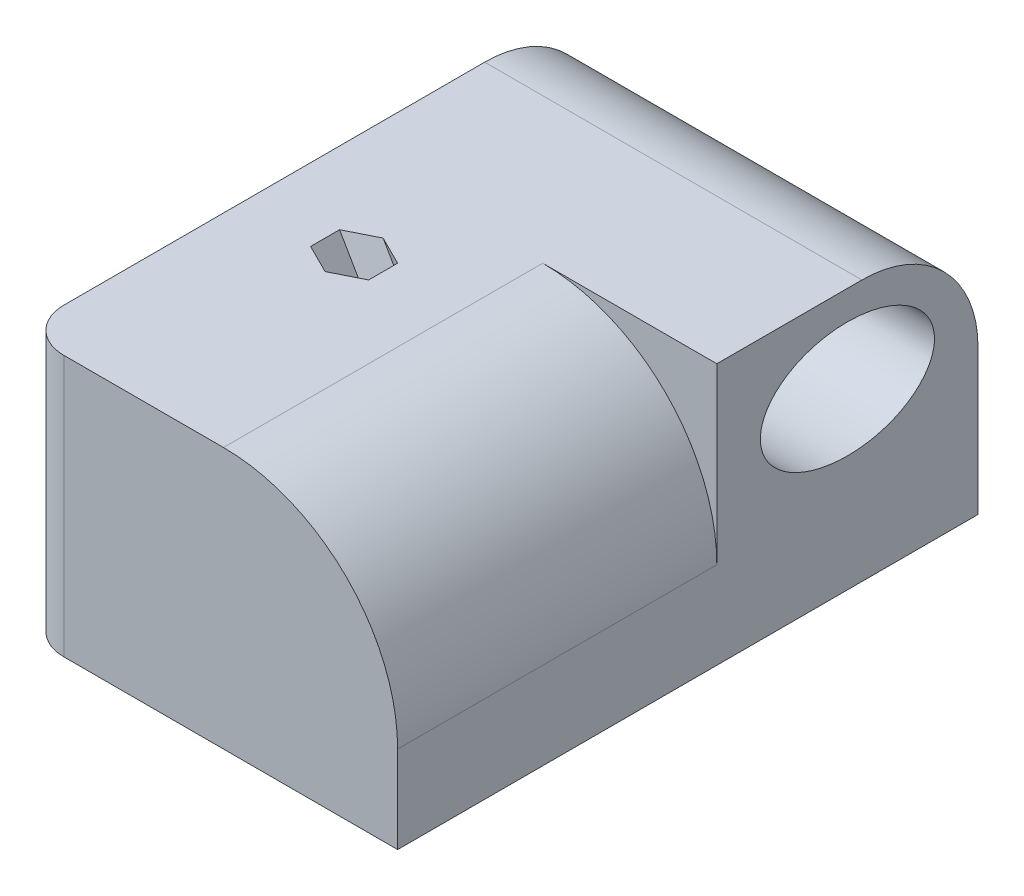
ISO-10303-21;
HEADER;
FILE_DESCRIPTION(('STEP AP214'),'2;1');
FILE_NAME('part.step','',(''),(''),'','','');
FILE_SCHEMA(('AUTOMOTIVE_DESIGN { 1 0 10303 214 1 1 1 1 }'));
ENDSEC;
DATA;
#1=APPLICATION_CONTEXT('core data for automotive mechanical design processes');
#2=APPLICATION_PROTOCOL_DEFINITION('international standard','automotive_design',2000,#1);
#3=PRODUCT_CONTEXT('',#1,'mechanical');
#4=PRODUCT('Part','Part','',(#3));
#5=PRODUCT_RELATED_PRODUCT_CATEGORY('part','',(#4));
#6=PRODUCT_DEFINITION_FORMATION('','',#4);
#7=PRODUCT_DEFINITION_CONTEXT('part definition',#1,'design');
#8=PRODUCT_DEFINITION('design','',#6,#7);
#9=PRODUCT_DEFINITION_SHAPE('','',#8);
#10=(LENGTH_UNIT() NAMED_UNIT(*) SI_UNIT(.MILLI.,.METRE.));
#11=(NAMED_UNIT(*) PLANE_ANGLE_UNIT() SI_UNIT($,.RADIAN.));
#12=(NAMED_UNIT(*) SI_UNIT($,.STERADIAN.) SOLID_ANGLE_UNIT());
#13=UNCERTAINTY_MEASURE_WITH_UNIT(LENGTH_MEASURE(1.E-05),#10,'distance_accuracy_value','');
#14=(GEOMETRIC_REPRESENTATION_CONTEXT(3) GLOBAL_UNCERTAINTY_ASSIGNED_CONTEXT((#13)) GLOBAL_UNIT_ASSIGNED_CONTEXT((#10,
#11,#12)) REPRESENTATION_CONTEXT('',''));
#15=CARTESIAN_POINT('',(0.,0.,0.));
#16=DIRECTION('',(0.,0.,1.));
#17=DIRECTION('',(1.,0.,0.));
#18=AXIS2_PLACEMENT_3D('',#15,#16,#17);
#19=CARTESIAN_POINT('',(-65.,90.,100.));
#20=DIRECTION('',(0.,0.,-1.));
#21=DIRECTION('',(-1.,0.,0.));
#22=AXIS2_PLACEMENT_3D('',#19,#20,#21);
#23=PLANE('',#22);
#24=DIRECTION('',(0.,-1.,0.));
#25=VECTOR('',#24,1.);
#26=CARTESIAN_POINT('',(65.,90.,100.));
#27=LINE('',#26,#25);
#28=CARTESIAN_POINT('',(65.,30.,100.));
#29=VERTEX_POINT('',#28);
#30=CARTESIAN_POINT('',(65.,0.,100.));
#31=VERTEX_POINT('',#30);
#32=EDGE_CURVE('E223',#29,#31,#27,.T.);
#33=ORIENTED_EDGE('',*,*,#32,.F.);
#34=CARTESIAN_POINT('',(5.00000000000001,30.,100.));
#35=DIRECTION('',(0.,0.,-1.));
#36=DIRECTION('',(-1.,0.,0.));
#37=AXIS2_PLACEMENT_3D('',#34,#35,#36);
#38=CIRCLE('',#37,60.);
#39=CARTESIAN_POINT('',(5.,90.,100.));
#40=VERTEX_POINT('',#39);
#41=EDGE_CURVE('E272',#29,#40,#38,.F.);
#42=ORIENTED_EDGE('',*,*,#41,.T.);
#43=DIRECTION('',(1.,0.,0.));
#44=VECTOR('',#43,1.);
#45=CARTESIAN_POINT('',(-65.,90.,100.));
#46=LINE('',#45,#44);
#47=CARTESIAN_POINT('',(-50.,90.,100.));
#48=VERTEX_POINT('',#47);
#49=EDGE_CURVE('E192',#48,#40,#46,.T.);
#50=ORIENTED_EDGE('',*,*,#49,.F.);
#51=DIRECTION('',(0.,-1.,0.));
#52=VECTOR('',#51,1.);
#53=CARTESIAN_POINT('',(-50.,0.,100.));
#54=LINE('',#53,#52);
#55=CARTESIAN_POINT('',(-50.,0.,100.));
#56=VERTEX_POINT('',#55);
#57=EDGE_CURVE('E226',#48,#56,#54,.T.);
#58=ORIENTED_EDGE('',*,*,#57,.T.);
#59=DIRECTION('',(1.,0.,0.));
#60=VECTOR('',#59,1.);
#61=CARTESIAN_POINT('',(-65.,0.,100.));
#62=LINE('',#61,#60);
#63=EDGE_CURVE('E191',#56,#31,#62,.T.);
#64=ORIENTED_EDGE('',*,*,#63,.T.);
#65=EDGE_LOOP('',(#33,#42,#50,#58,#64));
#66=FACE_BOUND('',#65,.T.);
#67=ADVANCED_FACE('F43',(#66),#23,.F.);
#68=CARTESIAN_POINT('',(65.,90.,100.));
#69=DIRECTION('',(-1.,0.,0.));
#70=DIRECTION('',(0.,0.,1.));
#71=AXIS2_PLACEMENT_3D('',#68,#69,#70);
#72=PLANE('',#71);
#73=CARTESIAN_POINT('',(65.,60.,-55.));
#74=DIRECTION('',(1.,0.,0.));
#75=DIRECTION('',(0.,0.,-1.));
#76=AXIS2_PLACEMENT_3D('',#73,#74,#75);
#77=ELLIPSE('',#76,30.,20.);
#78=CARTESIAN_POINT('',(65.,60.,-85.));
#79=VERTEX_POINT('',#78);
#80=EDGE_CURVE('E292',#79,#79,#77,.T.);
#81=ORIENTED_EDGE('',*,*,#80,.F.);
#82=EDGE_LOOP('',(#81));
#83=FACE_BOUND('',#82,.T.);
#84=DIRECTION('',(0.,-1.,0.));
#85=VECTOR('',#84,1.);
#86=CARTESIAN_POINT('',(65.,90.,-100.));
#87=LINE('',#86,#85);
#88=CARTESIAN_POINT('',(65.,50.,-100.));
#89=VERTEX_POINT('',#88);
#90=CARTESIAN_POINT('',(65.,0.,-100.));
#91=VERTEX_POINT('',#90);
#92=EDGE_CURVE('E220',#89,#91,#87,.T.);
#93=ORIENTED_EDGE('',*,*,#92,.F.);
#94=CARTESIAN_POINT('',(65.,50.,-60.));
#95=DIRECTION('',(-1.,0.,0.));
#96=DIRECTION('',(0.,0.,1.));
#97=AXIS2_PLACEMENT_3D('',#94,#95,#96);
#98=CIRCLE('',#97,40.);
#99=CARTESIAN_POINT('',(65.,90.,-60.));
#100=VERTEX_POINT('',#99);
#101=EDGE_CURVE('E66',#89,#100,#98,.F.);
#102=ORIENTED_EDGE('',*,*,#101,.T.);
#103=DIRECTION('',(0.,0.,-1.));
#104=VECTOR('',#103,1.);
#105=CARTESIAN_POINT('',(65.,90.,100.));
#106=LINE('',#105,#104);
#107=CARTESIAN_POINT('',(65.,90.,-9.99999999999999));
#108=VERTEX_POINT('',#107);
#109=EDGE_CURVE('E196',#108,#100,#106,.T.);
#110=ORIENTED_EDGE('',*,*,#109,.F.);
#111=DIRECTION('',(0.,-1.,0.));
#112=VECTOR('',#111,1.);
#113=CARTESIAN_POINT('',(65.,30.,-9.99999999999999));
#114=LINE('',#113,#112);
#115=CARTESIAN_POINT('',(65.,30.,-9.99999999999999));
#116=VERTEX_POINT('',#115);
#117=EDGE_CURVE('E269',#108,#116,#114,.T.);
#118=ORIENTED_EDGE('',*,*,#117,.T.);
#119=DIRECTION('',(0.,0.,-1.));
#120=VECTOR('',#119,1.);
#121=CARTESIAN_POINT('',(65.,30.,100.));
#122=LINE('',#121,#120);
#123=EDGE_CURVE('E266',#116,#29,#122,.F.);
#124=ORIENTED_EDGE('',*,*,#123,.T.);
#125=ORIENTED_EDGE('',*,*,#32,.T.);
#126=DIRECTION('',(0.,0.,-1.));
#127=VECTOR('',#126,1.);
#128=CARTESIAN_POINT('',(65.,0.,100.));
#129=LINE('',#128,#127);
#130=EDGE_CURVE('E207',#31,#91,#129,.T.);
#131=ORIENTED_EDGE('',*,*,#130,.T.);
#132=EDGE_LOOP('',(#93,#102,#110,#118,#124,#125,#131));
#133=FACE_BOUND('',#132,.T.);
#134=ADVANCED_FACE('F359',(#83,#133),#72,.F.);
#135=CARTESIAN_POINT('',(-65.,90.,-100.));
#136=DIRECTION('',(0.,0.,-1.));
#137=DIRECTION('',(-1.,0.,0.));
#138=AXIS2_PLACEMENT_3D('',#135,#136,#137);
#139=PLANE('',#138);
#140=DIRECTION('',(0.,-1.,0.));
#141=VECTOR('',#140,1.);
#142=CARTESIAN_POINT('',(-65.,90.,-100.));
#143=LINE('',#142,#141);
#144=CARTESIAN_POINT('',(-65.,50.,-100.));
#145=VERTEX_POINT('',#144);
#146=CARTESIAN_POINT('',(-65.,0.,-100.));
#147=VERTEX_POINT('',#146);
#148=EDGE_CURVE('E203',#145,#147,#143,.T.);
#149=ORIENTED_EDGE('',*,*,#148,.F.);
#150=DIRECTION('',(1.,0.,0.));
#151=VECTOR('',#150,1.);
#152=CARTESIAN_POINT('',(-65.,50.,-100.));
#153=LINE('',#152,#151);
#154=EDGE_CURVE('E275',#145,#89,#153,.T.);
#155=ORIENTED_EDGE('',*,*,#154,.T.);
#156=ORIENTED_EDGE('',*,*,#92,.T.);
#157=DIRECTION('',(1.,0.,0.));
#158=VECTOR('',#157,1.);
#159=CARTESIAN_POINT('',(-65.,0.,-100.));
#160=LINE('',#159,#158);
#161=EDGE_CURVE('E211',#147,#91,#160,.T.);
#162=ORIENTED_EDGE('',*,*,#161,.F.);
#163=EDGE_LOOP('',(#149,#155,#156,#162));
#164=FACE_BOUND('',#163,.T.);
#165=ADVANCED_FACE('F355',(#164),#139,.T.);
#166=CARTESIAN_POINT('',(-65.,90.,100.));
#167=DIRECTION('',(-1.,0.,0.));
#168=DIRECTION('',(0.,0.,1.));
#169=AXIS2_PLACEMENT_3D('',#166,#167,#168);
#170=PLANE('',#169);
#171=DIRECTION('',(0.,0.,-1.));
#172=VECTOR('',#171,1.);
#173=CARTESIAN_POINT('',(-65.,90.,100.));
#174=LINE('',#173,#172);
#175=CARTESIAN_POINT('',(-65.,90.,85.));
#176=VERTEX_POINT('',#175);
#177=CARTESIAN_POINT('',(-65.,90.,-60.));
#178=VERTEX_POINT('',#177);
#179=EDGE_CURVE('E200',#176,#178,#174,.T.);
#180=ORIENTED_EDGE('',*,*,#179,.T.);
#181=CARTESIAN_POINT('',(-65.,50.,-60.));
#182=DIRECTION('',(-1.,0.,0.));
#183=DIRECTION('',(0.,0.,1.));
#184=AXIS2_PLACEMENT_3D('',#181,#182,#183);
#185=CIRCLE('',#184,40.);
#186=EDGE_CURVE('E11',#178,#145,#185,.T.);
#187=ORIENTED_EDGE('',*,*,#186,.T.);
#188=ORIENTED_EDGE('',*,*,#148,.T.);
#189=DIRECTION('',(0.,0.,-1.));
#190=VECTOR('',#189,1.);
#191=CARTESIAN_POINT('',(-65.,0.,100.));
#192=LINE('',#191,#190);
#193=CARTESIAN_POINT('',(-65.,0.,85.));
#194=VERTEX_POINT('',#193);
#195=EDGE_CURVE('E197',#194,#147,#192,.T.);
#196=ORIENTED_EDGE('',*,*,#195,.F.);
#197=DIRECTION('',(0.,-1.,0.));
#198=VECTOR('',#197,1.);
#199=CARTESIAN_POINT('',(-65.,90.,85.));
#200=LINE('',#199,#198);
#201=EDGE_CURVE('E233',#194,#176,#200,.F.);
#202=ORIENTED_EDGE('',*,*,#201,.T.);
#203=EDGE_LOOP('',(#180,#187,#188,#196,#202));
#204=FACE_BOUND('',#203,.T.);
#205=ADVANCED_FACE('F349',(#204),#170,.T.);
#206=CARTESIAN_POINT('',(0.,90.,0.));
#207=DIRECTION('',(0.,1.,0.));
#208=DIRECTION('',(0.,0.,1.));
#209=AXIS2_PLACEMENT_3D('',#206,#207,#208);
#210=PLANE('',#209);
#211=DIRECTION('',(-0.894427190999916,0.,-0.447213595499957));
#212=VECTOR('',#211,1.);
#213=CARTESIAN_POINT('',(-9.99999999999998,90.,20.));
#214=LINE('',#213,#212);
#215=CARTESIAN_POINT('',(-20.,90.,15.));
#216=VERTEX_POINT('',#215);
#217=CARTESIAN_POINT('',(-30.,90.,9.99999999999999));
#218=VERTEX_POINT('',#217);
#219=EDGE_CURVE('E188',#216,#218,#214,.T.);
#220=ORIENTED_EDGE('',*,*,#219,.F.);
#221=DIRECTION('',(0.,0.,-1.));
#222=VECTOR('',#221,1.);
#223=CARTESIAN_POINT('',(-20.,90.,0.));
#224=LINE('',#223,#222);
#225=CARTESIAN_POINT('',(-20.,90.,25.));
#226=VERTEX_POINT('',#225);
#227=EDGE_CURVE('E185',#226,#216,#224,.T.);
#228=ORIENTED_EDGE('',*,*,#227,.F.);
#229=DIRECTION('',(0.894427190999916,0.,-0.447213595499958));
#230=VECTOR('',#229,1.);
#231=CARTESIAN_POINT('',(6.00000000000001,90.,12.));
#232=LINE('',#231,#230);
#233=CARTESIAN_POINT('',(-30.,90.,30.));
#234=VERTEX_POINT('',#233);
#235=EDGE_CURVE('E179',#234,#226,#232,.T.);
#236=ORIENTED_EDGE('',*,*,#235,.F.);
#237=DIRECTION('',(0.894427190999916,0.,0.447213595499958));
#238=VECTOR('',#237,1.);
#239=CARTESIAN_POINT('',(-18.,90.,36.));
#240=LINE('',#239,#238);
#241=CARTESIAN_POINT('',(-40.,90.,25.));
#242=VERTEX_POINT('',#241);
#243=EDGE_CURVE('E172',#242,#234,#240,.T.);
#244=ORIENTED_EDGE('',*,*,#243,.F.);
#245=DIRECTION('',(0.,0.,1.));
#246=VECTOR('',#245,1.);
#247=CARTESIAN_POINT('',(-40.,90.,0.));
#248=LINE('',#247,#246);
#249=CARTESIAN_POINT('',(-40.,90.,15.));
#250=VERTEX_POINT('',#249);
#251=EDGE_CURVE('E156',#250,#242,#248,.T.);
#252=ORIENTED_EDGE('',*,*,#251,.F.);
#253=DIRECTION('',(-0.894427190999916,0.,0.447213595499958));
#254=VECTOR('',#253,1.);
#255=CARTESIAN_POINT('',(-2.,90.,-4.));
#256=LINE('',#255,#254);
#257=EDGE_CURVE('E144',#218,#250,#256,.T.);
#258=ORIENTED_EDGE('',*,*,#257,.F.);
#259=EDGE_LOOP('',(#220,#228,#236,#244,#252,#258));
#260=FACE_BOUND('',#259,.T.);
#261=ORIENTED_EDGE('',*,*,#109,.T.);
#262=DIRECTION('',(1.,0.,0.));
#263=VECTOR('',#262,1.);
#264=CARTESIAN_POINT('',(0.,90.,-60.));
#265=LINE('',#264,#263);
#266=EDGE_CURVE('E52',#100,#178,#265,.F.);
#267=ORIENTED_EDGE('',*,*,#266,.T.);
#268=ORIENTED_EDGE('',*,*,#179,.F.);
#269=CARTESIAN_POINT('',(-50.,90.,85.));
#270=DIRECTION('',(0.,1.,0.));
#271=DIRECTION('',(0.,0.,1.));
#272=AXIS2_PLACEMENT_3D('',#269,#270,#271);
#273=CIRCLE('',#272,15.);
#274=EDGE_CURVE('E236',#176,#48,#273,.T.);
#275=ORIENTED_EDGE('',*,*,#274,.T.);
#276=ORIENTED_EDGE('',*,*,#49,.T.);
#277=DIRECTION('',(0.,0.,-1.));
#278=VECTOR('',#277,1.);
#279=CARTESIAN_POINT('',(5.00000000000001,90.,-100.));
#280=LINE('',#279,#278);
#281=CARTESIAN_POINT('',(5.00000000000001,90.,-9.99999999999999));
#282=VERTEX_POINT('',#281);
#283=EDGE_CURVE('E262',#40,#282,#280,.T.);
#284=ORIENTED_EDGE('',*,*,#283,.T.);
#285=DIRECTION('',(1.,0.,0.));
#286=VECTOR('',#285,1.);
#287=CARTESIAN_POINT('',(0.,90.,-9.99999999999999));
#288=LINE('',#287,#286);
#289=EDGE_CURVE('E259',#282,#108,#288,.T.);
#290=ORIENTED_EDGE('',*,*,#289,.T.);
#291=EDGE_LOOP('',(#261,#267,#268,#275,#276,#284,#290));
#292=FACE_BOUND('',#291,.T.);
#293=ADVANCED_FACE('F170',(#260,#292),#210,.T.);
#294=CARTESIAN_POINT('',(0.,0.,0.));
#295=DIRECTION('',(0.,1.,0.));
#296=DIRECTION('',(0.,0.,1.));
#297=AXIS2_PLACEMENT_3D('',#294,#295,#296);
#298=PLANE('',#297);
#299=DIRECTION('',(0.,0.,-1.));
#300=VECTOR('',#299,1.);
#301=CARTESIAN_POINT('',(31.9615242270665,0.,0.));
#302=LINE('',#301,#300);
#303=CARTESIAN_POINT('',(31.9615242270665,0.,25.));
#304=VERTEX_POINT('',#303);
#305=CARTESIAN_POINT('',(31.9615242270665,0.,15.));
#306=VERTEX_POINT('',#305);
#307=EDGE_CURVE('E251',#304,#306,#302,.T.);
#308=ORIENTED_EDGE('',*,*,#307,.T.);
#309=DIRECTION('',(-0.894427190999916,0.,-0.447213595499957));
#310=VECTOR('',#309,1.);
#311=CARTESIAN_POINT('',(0.392304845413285,0.,-0.784609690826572));
#312=LINE('',#311,#310);
#313=CARTESIAN_POINT('',(21.9615242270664,0.,9.99999999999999));
#314=VERTEX_POINT('',#313);
#315=EDGE_CURVE('E255',#306,#314,#312,.T.);
#316=ORIENTED_EDGE('',*,*,#315,.T.);
#317=DIRECTION('',(-0.894427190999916,0.,0.447213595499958));
#318=VECTOR('',#317,1.);
#319=CARTESIAN_POINT('',(8.39230484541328,0.,16.7846096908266));
#320=LINE('',#319,#318);
#321=CARTESIAN_POINT('',(11.9615242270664,0.,15.));
#322=VERTEX_POINT('',#321);
#323=EDGE_CURVE('E239',#314,#322,#320,.T.);
#324=ORIENTED_EDGE('',*,*,#323,.T.);
#325=DIRECTION('',(0.,0.,1.));
#326=VECTOR('',#325,1.);
#327=CARTESIAN_POINT('',(11.9615242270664,0.,0.));
#328=LINE('',#327,#326);
#329=CARTESIAN_POINT('',(11.9615242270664,0.,25.));
#330=VERTEX_POINT('',#329);
#331=EDGE_CURVE('E164',#322,#330,#328,.T.);
#332=ORIENTED_EDGE('',*,*,#331,.T.);
#333=DIRECTION('',(0.894427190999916,0.,0.447213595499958));
#334=VECTOR('',#333,1.);
#335=CARTESIAN_POINT('',(-7.60769515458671,0.,15.2153903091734));
#336=LINE('',#335,#334);
#337=CARTESIAN_POINT('',(21.9615242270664,0.,30.));
#338=VERTEX_POINT('',#337);
#339=EDGE_CURVE('E243',#330,#338,#336,.T.);
#340=ORIENTED_EDGE('',*,*,#339,.T.);
#341=DIRECTION('',(0.894427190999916,0.,-0.447213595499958));
#342=VECTOR('',#341,1.);
#343=CARTESIAN_POINT('',(16.3923048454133,0.,32.7846096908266));
#344=LINE('',#343,#342);
#345=EDGE_CURVE('E247',#338,#304,#344,.T.);
#346=ORIENTED_EDGE('',*,*,#345,.T.);
#347=EDGE_LOOP('',(#308,#316,#324,#332,#340,#346));
#348=FACE_BOUND('',#347,.T.);
#349=ORIENTED_EDGE('',*,*,#63,.F.);
#350=CARTESIAN_POINT('',(-50.,0.,85.));
#351=DIRECTION('',(0.,1.,0.));
#352=DIRECTION('',(0.,0.,1.));
#353=AXIS2_PLACEMENT_3D('',#350,#351,#352);
#354=CIRCLE('',#353,15.);
#355=EDGE_CURVE('E230',#56,#194,#354,.F.);
#356=ORIENTED_EDGE('',*,*,#355,.T.);
#357=ORIENTED_EDGE('',*,*,#195,.T.);
#358=ORIENTED_EDGE('',*,*,#161,.T.);
#359=ORIENTED_EDGE('',*,*,#130,.F.);
#360=EDGE_LOOP('',(#349,#356,#357,#358,#359));
#361=FACE_BOUND('',#360,.T.);
#362=ADVANCED_FACE('F348',(#348,#361),#298,.F.);
#363=CARTESIAN_POINT('',(-50.,90.,85.));
#364=DIRECTION('',(0.,1.,0.));
#365=DIRECTION('',(0.,0.,1.));
#366=AXIS2_PLACEMENT_3D('',#363,#364,#365);
#367=CYLINDRICAL_SURFACE('',#366,15.);
#368=ORIENTED_EDGE('',*,*,#274,.F.);
#369=ORIENTED_EDGE('',*,*,#201,.F.);
#370=ORIENTED_EDGE('',*,*,#355,.F.);
#371=ORIENTED_EDGE('',*,*,#57,.F.);
#372=EDGE_LOOP('',(#368,#369,#370,#371));
#373=FACE_BOUND('',#372,.T.);
#374=ADVANCED_FACE('F344',(#373),#367,.T.);
#375=CARTESIAN_POINT('',(40.2211431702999,-14.3060796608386,15.));
#376=DIRECTION('',(0.433012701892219,0.25,-0.866025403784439));
#377=DIRECTION('',(-0.894427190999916,0.,-0.447213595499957));
#378=AXIS2_PLACEMENT_3D('',#375,#376,#377);
#379=PLANE('',#378);
#380=ORIENTED_EDGE('',*,*,#219,.T.);
#381=DIRECTION('',(-0.500000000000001,0.866025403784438,0.));
#382=VECTOR('',#381,1.);
#383=CARTESIAN_POINT('',(32.7211431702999,-18.6362066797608,9.99999999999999));
#384=LINE('',#383,#382);
#385=EDGE_CURVE('E150',#314,#218,#384,.T.);
#386=ORIENTED_EDGE('',*,*,#385,.F.);
#387=ORIENTED_EDGE('',*,*,#315,.F.);
#388=DIRECTION('',(-0.500000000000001,0.866025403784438,0.));
#389=VECTOR('',#388,1.);
#390=CARTESIAN_POINT('',(40.2211431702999,-14.3060796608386,15.));
#391=LINE('',#390,#389);
#392=EDGE_CURVE('E157',#306,#216,#391,.T.);
#393=ORIENTED_EDGE('',*,*,#392,.T.);
#394=EDGE_LOOP('',(#380,#386,#387,#393));
#395=FACE_BOUND('',#394,.T.);
#396=ADVANCED_FACE('F328',(#395),#379,.F.);
#397=CARTESIAN_POINT('',(40.2211431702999,-14.3060796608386,25.));
#398=DIRECTION('',(0.866025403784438,0.500000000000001,0.));
#399=DIRECTION('',(-0.500000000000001,0.866025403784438,0.));
#400=AXIS2_PLACEMENT_3D('',#397,#398,#399);
#401=PLANE('',#400);
#402=ORIENTED_EDGE('',*,*,#227,.T.);
#403=ORIENTED_EDGE('',*,*,#392,.F.);
#404=ORIENTED_EDGE('',*,*,#307,.F.);
#405=DIRECTION('',(-0.500000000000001,0.866025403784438,0.));
#406=VECTOR('',#405,1.);
#407=CARTESIAN_POINT('',(40.2211431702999,-14.3060796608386,25.));
#408=LINE('',#407,#406);
#409=EDGE_CURVE('E513',#304,#226,#408,.T.);
#410=ORIENTED_EDGE('',*,*,#409,.T.);
#411=EDGE_LOOP('',(#402,#403,#404,#410));
#412=FACE_BOUND('',#411,.T.);
#413=ADVANCED_FACE('F324',(#412),#401,.F.);
#414=CARTESIAN_POINT('',(32.7211431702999,-18.6362066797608,30.));
#415=DIRECTION('',(0.433012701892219,0.250000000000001,0.866025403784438));
#416=DIRECTION('',(0.894427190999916,0.,-0.447213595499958));
#417=AXIS2_PLACEMENT_3D('',#414,#415,#416);
#418=PLANE('',#417);
#419=ORIENTED_EDGE('',*,*,#235,.T.);
#420=ORIENTED_EDGE('',*,*,#409,.F.);
#421=ORIENTED_EDGE('',*,*,#345,.F.);
#422=DIRECTION('',(-0.500000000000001,0.866025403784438,0.));
#423=VECTOR('',#422,1.);
#424=CARTESIAN_POINT('',(32.7211431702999,-18.6362066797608,30.));
#425=LINE('',#424,#423);
#426=EDGE_CURVE('E519',#338,#234,#425,.T.);
#427=ORIENTED_EDGE('',*,*,#426,.T.);
#428=EDGE_LOOP('',(#419,#420,#421,#427));
#429=FACE_BOUND('',#428,.T.);
#430=ADVANCED_FACE('F327',(#429),#418,.F.);
#431=CARTESIAN_POINT('',(25.2211431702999,-22.966333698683,25.));
#432=DIRECTION('',(-0.433012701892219,-0.25,0.866025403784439));
#433=DIRECTION('',(0.894427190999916,0.,0.447213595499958));
#434=AXIS2_PLACEMENT_3D('',#431,#432,#433);
#435=PLANE('',#434);
#436=ORIENTED_EDGE('',*,*,#243,.T.);
#437=ORIENTED_EDGE('',*,*,#426,.F.);
#438=ORIENTED_EDGE('',*,*,#339,.F.);
#439=DIRECTION('',(-0.500000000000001,0.866025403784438,0.));
#440=VECTOR('',#439,1.);
#441=CARTESIAN_POINT('',(25.2211431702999,-22.966333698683,25.));
#442=LINE('',#441,#440);
#443=EDGE_CURVE('E167',#330,#242,#442,.T.);
#444=ORIENTED_EDGE('',*,*,#443,.T.);
#445=EDGE_LOOP('',(#436,#437,#438,#444));
#446=FACE_BOUND('',#445,.T.);
#447=ADVANCED_FACE('F332',(#446),#435,.F.);
#448=CARTESIAN_POINT('',(25.2211431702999,-22.966333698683,15.));
#449=DIRECTION('',(-0.866025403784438,-0.500000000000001,0.));
#450=DIRECTION('',(0.500000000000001,-0.866025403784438,0.));
#451=AXIS2_PLACEMENT_3D('',#448,#449,#450);
#452=PLANE('',#451);
#453=ORIENTED_EDGE('',*,*,#251,.T.);
#454=ORIENTED_EDGE('',*,*,#443,.F.);
#455=ORIENTED_EDGE('',*,*,#331,.F.);
#456=DIRECTION('',(-0.500000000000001,0.866025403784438,0.));
#457=VECTOR('',#456,1.);
#458=CARTESIAN_POINT('',(25.2211431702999,-22.966333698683,15.));
#459=LINE('',#458,#457);
#460=EDGE_CURVE('E147',#322,#250,#459,.T.);
#461=ORIENTED_EDGE('',*,*,#460,.T.);
#462=EDGE_LOOP('',(#453,#454,#455,#461));
#463=FACE_BOUND('',#462,.T.);
#464=ADVANCED_FACE('F160',(#463),#452,.F.);
#465=CARTESIAN_POINT('',(32.7211431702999,-18.6362066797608,9.99999999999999));
#466=DIRECTION('',(-0.433012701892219,-0.250000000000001,-0.866025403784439));
#467=DIRECTION('',(-0.894427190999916,0.,0.447213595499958));
#468=AXIS2_PLACEMENT_3D('',#465,#466,#467);
#469=PLANE('',#468);
#470=ORIENTED_EDGE('',*,*,#257,.T.);
#471=ORIENTED_EDGE('',*,*,#460,.F.);
#472=ORIENTED_EDGE('',*,*,#323,.F.);
#473=ORIENTED_EDGE('',*,*,#385,.T.);
#474=EDGE_LOOP('',(#470,#471,#472,#473));
#475=FACE_BOUND('',#474,.T.);
#476=ADVANCED_FACE('F146',(#475),#469,.F.);
#477=CARTESIAN_POINT('',(5.00000000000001,30.,-9.99999999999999));
#478=DIRECTION('',(0.,0.,1.));
#479=DIRECTION('',(1.,0.,0.));
#480=AXIS2_PLACEMENT_3D('',#477,#478,#479);
#481=PLANE('',#480);
#482=ORIENTED_EDGE('',*,*,#117,.F.);
#483=ORIENTED_EDGE('',*,*,#289,.F.);
#484=CARTESIAN_POINT('',(5.00000000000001,30.,-9.99999999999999));
#485=DIRECTION('',(0.,0.,-1.));
#486=DIRECTION('',(-1.,0.,0.));
#487=AXIS2_PLACEMENT_3D('',#484,#485,#486);
#488=CIRCLE('',#487,60.);
#489=EDGE_CURVE('E276',#116,#282,#488,.F.);
#490=ORIENTED_EDGE('',*,*,#489,.F.);
#491=EDGE_LOOP('',(#482,#483,#490));
#492=FACE_BOUND('',#491,.T.);
#493=ADVANCED_FACE('F341',(#492),#481,.T.);
#494=CARTESIAN_POINT('',(5.00000000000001,30.,0.));
#495=DIRECTION('',(0.,0.,1.));
#496=DIRECTION('',(1.,0.,0.));
#497=AXIS2_PLACEMENT_3D('',#494,#495,#496);
#498=CYLINDRICAL_SURFACE('',#497,60.);
#499=ORIENTED_EDGE('',*,*,#41,.F.);
#500=ORIENTED_EDGE('',*,*,#123,.F.);
#501=ORIENTED_EDGE('',*,*,#489,.T.);
#502=ORIENTED_EDGE('',*,*,#283,.F.);
#503=EDGE_LOOP('',(#499,#500,#501,#502));
#504=FACE_BOUND('',#503,.T.);
#505=ADVANCED_FACE('F322',(#504),#498,.T.);
#506=CARTESIAN_POINT('',(-50.,60.,-55.));
#507=DIRECTION('',(1.,0.,0.));
#508=DIRECTION('',(0.,0.,-1.));
#509=AXIS2_PLACEMENT_3D('',#506,#507,#508);
#510=ELLIPSE('',#509,30.,20.);
#511=DIRECTION('',(1.,0.,0.));
#512=VECTOR('',#511,1.);
#513=SURFACE_OF_LINEAR_EXTRUSION('',#510,#512);
#514=CARTESIAN_POINT('',(-50.,60.,-85.));
#515=VERTEX_POINT('',#514);
#516=EDGE_CURVE('E279',#515,#515,#510,.T.);
#517=ORIENTED_EDGE('',*,*,#516,.F.);
#518=EDGE_LOOP('',(#517));
#519=FACE_BOUND('',#518,.T.);
#520=ORIENTED_EDGE('',*,*,#80,.T.);
#521=EDGE_LOOP('',(#520));
#522=FACE_BOUND('',#521,.T.);
#523=ADVANCED_FACE('F317',(#519,#522),#513,.F.);
#524=CARTESIAN_POINT('',(-50.,60.,-55.));
#525=DIRECTION('',(1.,0.,0.));
#526=DIRECTION('',(0.,0.,-1.));
#527=AXIS2_PLACEMENT_3D('',#524,#525,#526);
#528=PLANE('',#527);
#529=ORIENTED_EDGE('',*,*,#516,.T.);
#530=EDGE_LOOP('',(#529));
#531=FACE_BOUND('',#530,.T.);
#532=ADVANCED_FACE('F321',(#531),#528,.T.);
#533=CARTESIAN_POINT('',(-65.,50.,-60.));
#534=DIRECTION('',(1.,0.,0.));
#535=DIRECTION('',(0.,0.,-1.));
#536=AXIS2_PLACEMENT_3D('',#533,#534,#535);
#537=CYLINDRICAL_SURFACE('',#536,40.);
#538=ORIENTED_EDGE('',*,*,#186,.F.);
#539=ORIENTED_EDGE('',*,*,#266,.F.);
#540=ORIENTED_EDGE('',*,*,#101,.F.);
#541=ORIENTED_EDGE('',*,*,#154,.F.);
#542=EDGE_LOOP('',(#538,#539,#540,#541));
#543=FACE_BOUND('',#542,.T.);
#544=ADVANCED_FACE('F45',(#543),#537,.T.);
#545=CLOSED_SHELL('',(#67,#134,#165,#205,#293,#362,#374,#396,#413,#430,#447,#464,#476,#493,#505,
#523,#532,#544));
#546=MANIFOLD_SOLID_BREP('B2',#545);
#547=ADVANCED_BREP_SHAPE_REPRESENTATION('',(#18,#546),#14);
#548=SHAPE_DEFINITION_REPRESENTATION(#9,#547);
ENDSEC;
END-ISO-10303-21;
